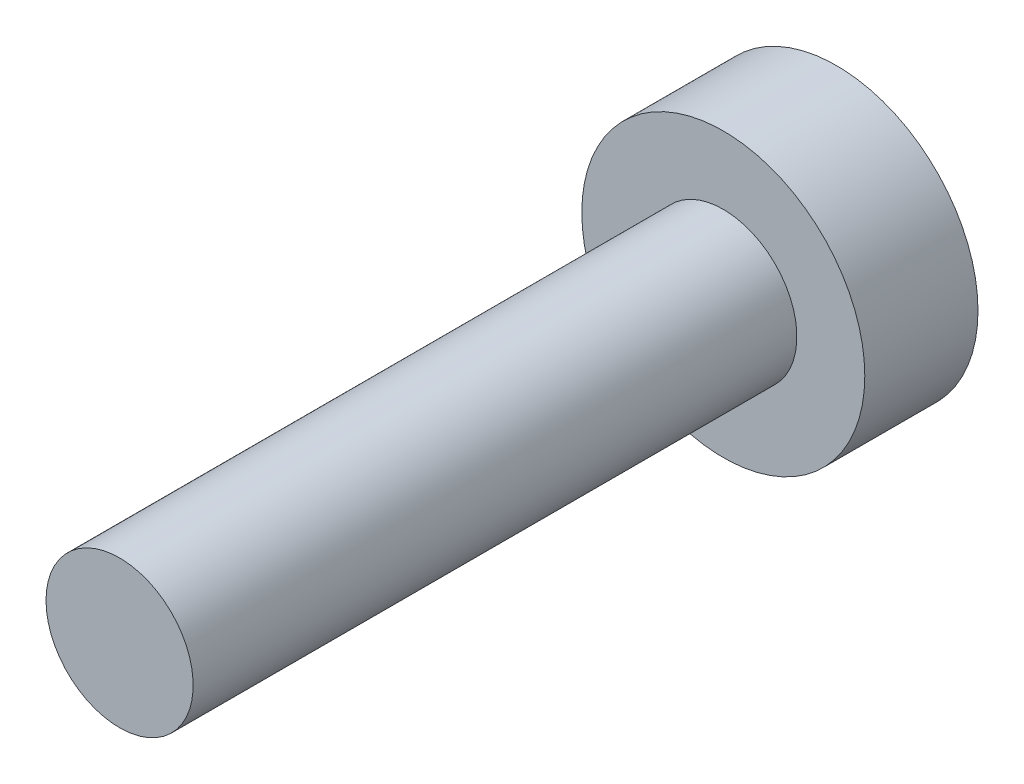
from build123d import *

# Parameters (mm, degrees)
ESQUISSE1_R              = 1.95
BASEEXTRUSION_DEPTH      = 16
ESQUISSE2_R              = 3.75
BOSSAGE_EXTRUSION1_DEPTH = 3


with BuildPart() as part:
    # Esquisse1 → BaseExtrusion (new body)
    with BuildSketch(Plane.XY):
        with Locations(Location((0, 0, 0), (0, 0, 180))):
            Circle(ESQUISSE1_R)
    extrude(amount=BASEEXTRUSION_DEPTH)

    # Esquisse2 → Bossage-Extrusion1 (add)
    with BuildSketch(Plane(origin=(0, 0, 0), x_dir=(-1, 0, 0), z_dir=(0, 0, -1))):
        with Locations(Location((0, 0, 0), (0, 0, 180))):
            Circle(ESQUISSE2_R)
    extrude(amount=BOSSAGE_EXTRUSION1_DEPTH)


solid = part.part
